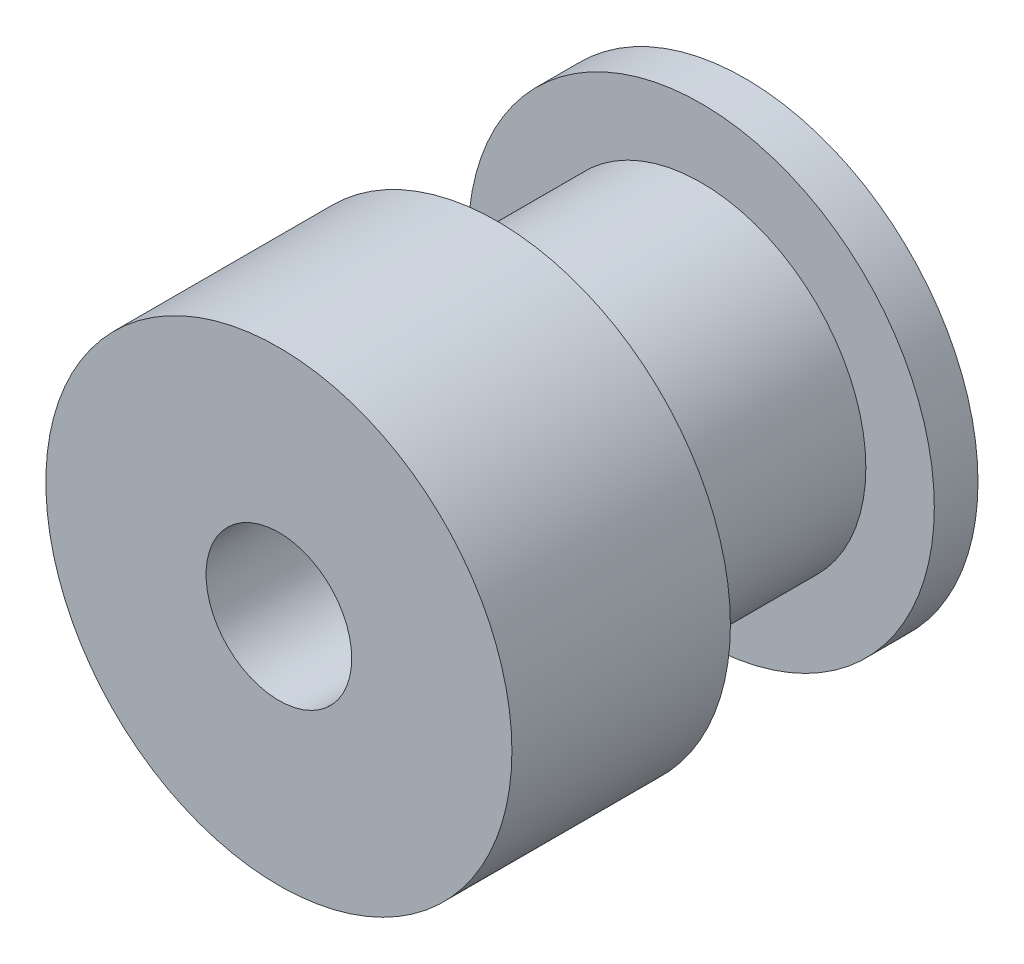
ISO-10303-21;
HEADER;
FILE_DESCRIPTION(('STEP AP214'),'2;1');
FILE_NAME('part.step','',(''),(''),'','','');
FILE_SCHEMA(('AUTOMOTIVE_DESIGN { 1 0 10303 214 1 1 1 1 }'));
ENDSEC;
DATA;
#1=APPLICATION_CONTEXT('core data for automotive mechanical design processes');
#2=APPLICATION_PROTOCOL_DEFINITION('international standard','automotive_design',2000,#1);
#3=PRODUCT_CONTEXT('',#1,'mechanical');
#4=PRODUCT('Part','Part','',(#3));
#5=PRODUCT_RELATED_PRODUCT_CATEGORY('part','',(#4));
#6=PRODUCT_DEFINITION_FORMATION('','',#4);
#7=PRODUCT_DEFINITION_CONTEXT('part definition',#1,'design');
#8=PRODUCT_DEFINITION('design','',#6,#7);
#9=PRODUCT_DEFINITION_SHAPE('','',#8);
#10=(LENGTH_UNIT() NAMED_UNIT(*) SI_UNIT(.MILLI.,.METRE.));
#11=(NAMED_UNIT(*) PLANE_ANGLE_UNIT() SI_UNIT($,.RADIAN.));
#12=(NAMED_UNIT(*) SI_UNIT($,.STERADIAN.) SOLID_ANGLE_UNIT());
#13=UNCERTAINTY_MEASURE_WITH_UNIT(LENGTH_MEASURE(1.E-05),#10,'distance_accuracy_value','');
#14=(GEOMETRIC_REPRESENTATION_CONTEXT(3) GLOBAL_UNCERTAINTY_ASSIGNED_CONTEXT((#13)) GLOBAL_UNIT_ASSIGNED_CONTEXT((#10,
#11,#12)) REPRESENTATION_CONTEXT('',''));
#15=CARTESIAN_POINT('',(0.,0.,0.));
#16=DIRECTION('',(0.,0.,1.));
#17=DIRECTION('',(1.,0.,0.));
#18=AXIS2_PLACEMENT_3D('',#15,#16,#17);
#19=CARTESIAN_POINT('',(0.,0.,1.5));
#20=DIRECTION('',(0.,0.,1.));
#21=DIRECTION('',(1.,0.,0.));
#22=AXIS2_PLACEMENT_3D('',#19,#20,#21);
#23=PLANE('',#22);
#24=CARTESIAN_POINT('',(0.,0.,1.5));
#25=DIRECTION('',(0.,0.,1.));
#26=DIRECTION('',(1.,0.,0.));
#27=AXIS2_PLACEMENT_3D('',#24,#25,#26);
#28=CIRCLE('',#27,8.);
#29=CARTESIAN_POINT('',(8.,0.,1.5));
#30=VERTEX_POINT('',#29);
#31=EDGE_CURVE('E10',#30,#30,#28,.T.);
#32=ORIENTED_EDGE('',*,*,#31,.T.);
#33=EDGE_LOOP('',(#32));
#34=FACE_BOUND('',#33,.T.);
#35=CARTESIAN_POINT('',(0.,0.,1.5));
#36=DIRECTION('',(0.,0.,1.));
#37=DIRECTION('',(1.,0.,0.));
#38=AXIS2_PLACEMENT_3D('',#35,#36,#37);
#39=CIRCLE('',#38,5.65);
#40=CARTESIAN_POINT('',(5.65,0.,1.5));
#41=VERTEX_POINT('',#40);
#42=EDGE_CURVE('E50',#41,#41,#39,.T.);
#43=ORIENTED_EDGE('',*,*,#42,.F.);
#44=EDGE_LOOP('',(#43));
#45=FACE_BOUND('',#44,.T.);
#46=ADVANCED_FACE('F34',(#34,#45),#23,.T.);
#47=CARTESIAN_POINT('',(0.,0.,0.));
#48=DIRECTION('',(0.,0.,1.));
#49=DIRECTION('',(1.,0.,0.));
#50=AXIS2_PLACEMENT_3D('',#47,#48,#49);
#51=PLANE('',#50);
#52=CARTESIAN_POINT('',(0.,0.,0.));
#53=DIRECTION('',(0.,0.,1.));
#54=DIRECTION('',(1.,0.,0.));
#55=AXIS2_PLACEMENT_3D('',#52,#53,#54);
#56=CIRCLE('',#55,8.);
#57=CARTESIAN_POINT('',(8.,0.,0.));
#58=VERTEX_POINT('',#57);
#59=EDGE_CURVE('E38',#58,#58,#56,.T.);
#60=ORIENTED_EDGE('',*,*,#59,.F.);
#61=EDGE_LOOP('',(#60));
#62=FACE_BOUND('',#61,.T.);
#63=CARTESIAN_POINT('',(0.,0.,0.));
#64=DIRECTION('',(0.,0.,1.));
#65=DIRECTION('',(1.,0.,0.));
#66=AXIS2_PLACEMENT_3D('',#63,#64,#65);
#67=CIRCLE('',#66,2.5);
#68=CARTESIAN_POINT('',(2.5,0.,0.));
#69=VERTEX_POINT('',#68);
#70=EDGE_CURVE('E45',#69,#69,#67,.T.);
#71=ORIENTED_EDGE('',*,*,#70,.T.);
#72=EDGE_LOOP('',(#71));
#73=FACE_BOUND('',#72,.T.);
#74=ADVANCED_FACE('F83',(#62,#73),#51,.F.);
#75=CARTESIAN_POINT('',(0.,0.,1.5));
#76=DIRECTION('',(0.,0.,-1.));
#77=DIRECTION('',(-1.,0.,0.));
#78=AXIS2_PLACEMENT_3D('',#75,#76,#77);
#79=CYLINDRICAL_SURFACE('',#78,8.);
#80=ORIENTED_EDGE('',*,*,#31,.F.);
#81=EDGE_LOOP('',(#80));
#82=FACE_BOUND('',#81,.T.);
#83=ORIENTED_EDGE('',*,*,#59,.T.);
#84=EDGE_LOOP('',(#83));
#85=FACE_BOUND('',#84,.T.);
#86=ADVANCED_FACE('F36',(#82,#85),#79,.T.);
#87=CARTESIAN_POINT('',(0.,0.,1.5));
#88=DIRECTION('',(0.,0.,-1.));
#89=DIRECTION('',(-1.,0.,0.));
#90=AXIS2_PLACEMENT_3D('',#87,#88,#89);
#91=CYLINDRICAL_SURFACE('',#90,2.5);
#92=ORIENTED_EDGE('',*,*,#70,.F.);
#93=EDGE_LOOP('',(#92));
#94=FACE_BOUND('',#93,.T.);
#95=CARTESIAN_POINT('',(0.,0.,16.));
#96=DIRECTION('',(0.,0.,1.));
#97=DIRECTION('',(1.,0.,0.));
#98=AXIS2_PLACEMENT_3D('',#95,#96,#97);
#99=CIRCLE('',#98,2.5);
#100=CARTESIAN_POINT('',(2.5,0.,16.));
#101=VERTEX_POINT('',#100);
#102=EDGE_CURVE('E59',#101,#101,#99,.T.);
#103=ORIENTED_EDGE('',*,*,#102,.T.);
#104=EDGE_LOOP('',(#103));
#105=FACE_BOUND('',#104,.T.);
#106=ADVANCED_FACE('F65',(#94,#105),#91,.F.);
#107=CARTESIAN_POINT('',(0.,0.,8.5));
#108=DIRECTION('',(0.,0.,-1.));
#109=DIRECTION('',(-1.,0.,0.));
#110=AXIS2_PLACEMENT_3D('',#107,#108,#109);
#111=CYLINDRICAL_SURFACE('',#110,5.65);
#112=CARTESIAN_POINT('',(0.,0.,8.5));
#113=DIRECTION('',(0.,0.,1.));
#114=DIRECTION('',(1.,0.,0.));
#115=AXIS2_PLACEMENT_3D('',#112,#113,#114);
#116=CIRCLE('',#115,5.65);
#117=CARTESIAN_POINT('',(5.65,0.,8.5));
#118=VERTEX_POINT('',#117);
#119=EDGE_CURVE('E49',#118,#118,#116,.T.);
#120=ORIENTED_EDGE('',*,*,#119,.F.);
#121=EDGE_LOOP('',(#120));
#122=FACE_BOUND('',#121,.T.);
#123=ORIENTED_EDGE('',*,*,#42,.T.);
#124=EDGE_LOOP('',(#123));
#125=FACE_BOUND('',#124,.T.);
#126=ADVANCED_FACE('F70',(#122,#125),#111,.T.);
#127=CARTESIAN_POINT('',(0.,0.,16.));
#128=DIRECTION('',(0.,0.,1.));
#129=DIRECTION('',(1.,0.,0.));
#130=AXIS2_PLACEMENT_3D('',#127,#128,#129);
#131=PLANE('',#130);
#132=CARTESIAN_POINT('',(0.,0.,16.));
#133=DIRECTION('',(0.,0.,1.));
#134=DIRECTION('',(1.,0.,0.));
#135=AXIS2_PLACEMENT_3D('',#132,#133,#134);
#136=CIRCLE('',#135,8.);
#137=CARTESIAN_POINT('',(8.,0.,16.));
#138=VERTEX_POINT('',#137);
#139=EDGE_CURVE('E53',#138,#138,#136,.T.);
#140=ORIENTED_EDGE('',*,*,#139,.T.);
#141=EDGE_LOOP('',(#140));
#142=FACE_BOUND('',#141,.T.);
#143=ORIENTED_EDGE('',*,*,#102,.F.);
#144=EDGE_LOOP('',(#143));
#145=FACE_BOUND('',#144,.T.);
#146=ADVANCED_FACE('F67',(#142,#145),#131,.T.);
#147=CARTESIAN_POINT('',(0.,0.,8.5));
#148=DIRECTION('',(0.,0.,1.));
#149=DIRECTION('',(1.,0.,0.));
#150=AXIS2_PLACEMENT_3D('',#147,#148,#149);
#151=PLANE('',#150);
#152=ORIENTED_EDGE('',*,*,#119,.T.);
#153=EDGE_LOOP('',(#152));
#154=FACE_BOUND('',#153,.T.);
#155=CARTESIAN_POINT('',(0.,0.,8.5));
#156=DIRECTION('',(0.,0.,1.));
#157=DIRECTION('',(1.,0.,0.));
#158=AXIS2_PLACEMENT_3D('',#155,#156,#157);
#159=CIRCLE('',#158,8.);
#160=CARTESIAN_POINT('',(8.,0.,8.5));
#161=VERTEX_POINT('',#160);
#162=EDGE_CURVE('E56',#161,#161,#159,.T.);
#163=ORIENTED_EDGE('',*,*,#162,.F.);
#164=EDGE_LOOP('',(#163));
#165=FACE_BOUND('',#164,.T.);
#166=ADVANCED_FACE('F69',(#154,#165),#151,.F.);
#167=CARTESIAN_POINT('',(0.,0.,16.));
#168=DIRECTION('',(0.,0.,-1.));
#169=DIRECTION('',(-1.,0.,0.));
#170=AXIS2_PLACEMENT_3D('',#167,#168,#169);
#171=CYLINDRICAL_SURFACE('',#170,8.);
#172=ORIENTED_EDGE('',*,*,#139,.F.);
#173=EDGE_LOOP('',(#172));
#174=FACE_BOUND('',#173,.T.);
#175=ORIENTED_EDGE('',*,*,#162,.T.);
#176=EDGE_LOOP('',(#175));
#177=FACE_BOUND('',#176,.T.);
#178=ADVANCED_FACE('F77',(#174,#177),#171,.T.);
#179=CLOSED_SHELL('',(#46,#74,#86,#106,#126,#146,#166,#178));
#180=MANIFOLD_SOLID_BREP('B2',#179);
#181=ADVANCED_BREP_SHAPE_REPRESENTATION('',(#18,#180),#14);
#182=SHAPE_DEFINITION_REPRESENTATION(#9,#181);
ENDSEC;
END-ISO-10303-21;
